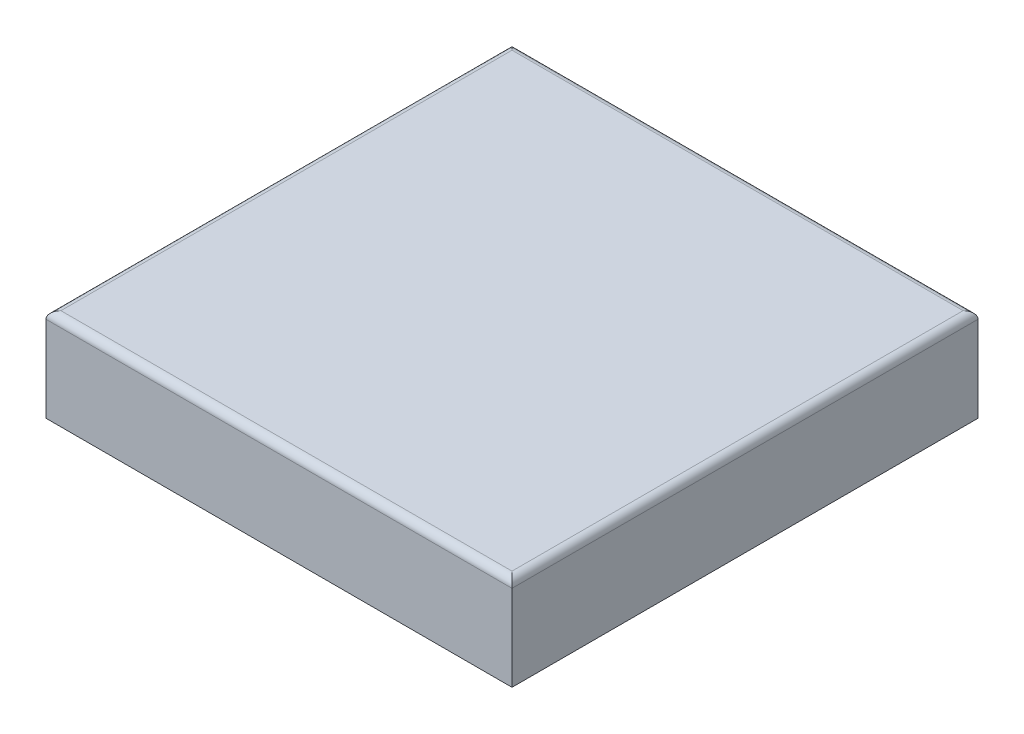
from build123d import *

# Parameters (mm, degrees)
SKETCH1_W           = 15.875
SKETCH1_H           = 15.875
BASE_EXTRUDE_DEPTH  = 3.175
SHELL1_T            = -1.5875
SKETCH4_R           = 1.27
BOSS_EXTRUDE2_DEPTH = 1.5875
CUT_EXTRUDE2_START  = -1.5875
SKETCH5_R           = 0.635
CUT_EXTRUDE2_DEPTH  = 1.5875
FILLET1_R           = 0.254


with BuildPart() as part:
    # Sketch1 → Base-Extrude (new body)
    with BuildSketch(Plane(origin=(0, 0, 0), x_dir=(1, 0, 0), z_dir=(0, 1, 0))):
        Rectangle(SKETCH1_W, SKETCH1_H)
    extrude(amount=BASE_EXTRUDE_DEPTH)

    # Shell1
    shell1_openings = [part.faces().sort_by_distance(p)[0] for p in [
        (0, 0, 0),
    ]]
    offset(amount=SHELL1_T, openings=shell1_openings, kind=Kind.INTERSECTION)

    # Sketch4 → Boss-Extrude2 (add)
    with BuildSketch(Plane.XZ.offset(-1.5875)):
        with Locations(Location((-3.81, 0, 0), (0, 0, 90))):
            Circle(SKETCH4_R)
        with Locations(Location((0, 3.81, 0), (0, 0, 90))):
            Circle(SKETCH4_R)
    extrude(amount=BOSS_EXTRUDE2_DEPTH)

    # Sketch5 → Cut-Extrude2 (cut)
    with BuildSketch(Plane.XZ.offset(CUT_EXTRUDE2_START)):
        with Locations(Location((0, 3.81, 0), (0, 0, 270))):
            Circle(SKETCH5_R)
        with Locations(Location((-3.81, 0, 0), (0, 0, 270))):
            Circle(SKETCH5_R)
    extrude(amount=CUT_EXTRUDE2_DEPTH, mode=Mode.SUBTRACT)

    # Fillet1
    fillet1_edges = [part.edges().sort_by_distance(p)[0] for p in [
        (7.9375, 3.175, 0),
        (0, 3.175, -7.9375),
        (-7.9375, 3.175, 0),
        (0, 3.175, 7.9375),
    ]]
    fillet(fillet1_edges, radius=FILLET1_R)


solid = part.part
